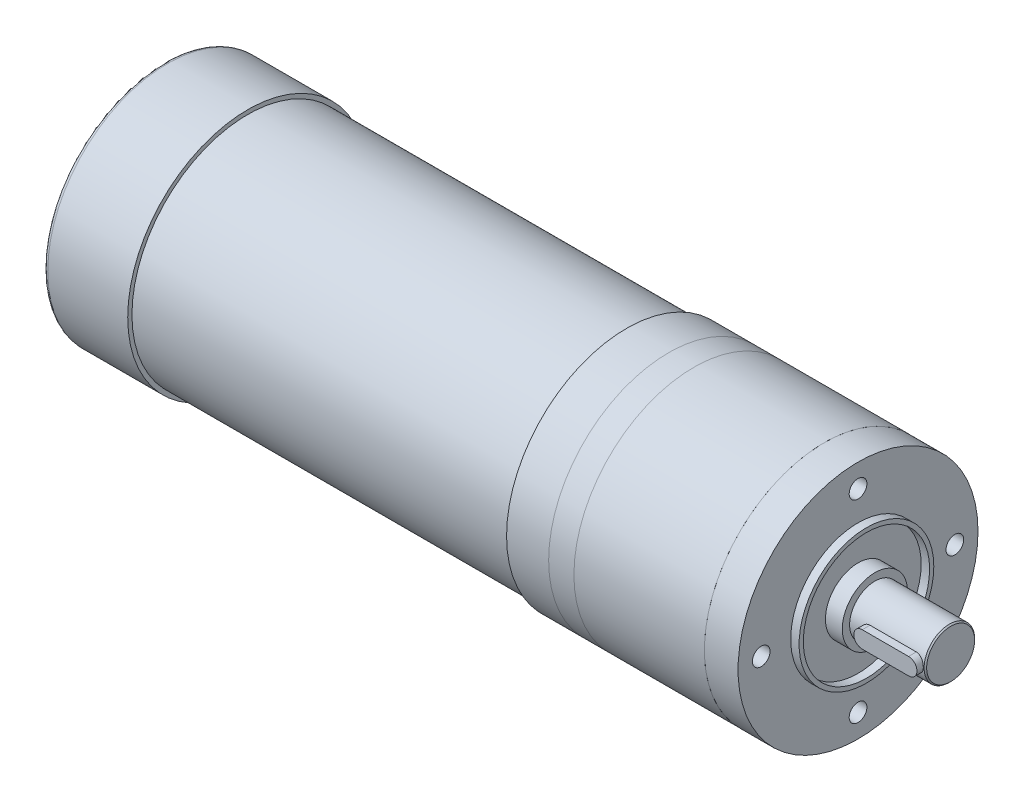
from build123d import *

# Parameters (mm, degrees)
SKETCH_1_R                  = 28.5
EXTRUDE_1_DEPTH             = 8
SKETCH_2_R                  = 28.5
EXTRUDE_2_DEPTH             = 31
SKETCH_3_R                  = 28.5
EXTRUDE_3_DEPTH             = 6
SKETCH_4_R                  = 28.5
EXTRUDE_4_DEPTH             = 10
SKETCH_5_R                  = 27.5
EXTRUDE_5_DEPTH             = 90
SKETCH_6_R                  = 28.5
EXTRUDE_6_DEPTH             = 20
FILLET_1_R                  = 1
SKETCH_7_R                  = 16
SKETCH_7_R_2                = 15
EXTRUDE_7_DEPTH             = 2
SKETCH_8_R                  = 7.75
EXTRUDE_8_DEPTH             = 4
SKETCH_9_R                  = 6
EXTRUDE_9_DEPTH             = 18
HOLE_WIZARD_M5_1_AT_2_COUNT = 2
HOLE_WIZARD_M5_1_AT_2_PITCH = 32.526911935
HOLE_WIZARD_M5_1_AT_3_COUNT = 2
HOLE_WIZARD_M5_1_AT_3_PITCH = 46
HOLE_WIZARD_M5_1_AT_4_COUNT = 2
HOLE_WIZARD_M5_1_AT_4_PITCH = 32.526911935
CUT_EXTRUDE_1_DEPTH         = 2.5
EXTRUDE_10_DEPTH            = 4
CHAMFER_1_SIZE              = 0.3


with BuildPart() as part:
    # Sketch 1 → Extrude 1 (new body)
    with BuildSketch(Plane(origin=(0, 0, 0), x_dir=(0, 0, -1), z_dir=(1, 0, 0))):
        Circle(SKETCH_1_R)
    extrude(amount=-EXTRUDE_1_DEPTH)

    # Sketch 7 → Extrude 7 (add)
    with BuildSketch(Plane(origin=(0, 0, 0), x_dir=(0, 0, -1), z_dir=(1, 0, 0))):
        Circle(SKETCH_7_R)
        Circle(SKETCH_7_R_2, mode=Mode.SUBTRACT)
    extrude(amount=EXTRUDE_7_DEPTH)

    # Sketch 8 → Extrude 8 (add)
    with BuildSketch(Plane(origin=(0, 0, 0), x_dir=(0, 0, -1), z_dir=(1, 0, 0))):
        Circle(SKETCH_8_R)
    extrude(amount=EXTRUDE_8_DEPTH)

    # Sketch 9 → Extrude 9 (add)
    with BuildSketch(Plane(origin=(4, 0, 0), x_dir=(0, 0, -1), z_dir=(1, 0, 0))):
        Circle(SKETCH_9_R)
    extrude(amount=EXTRUDE_9_DEPTH)


with BuildPart() as body_2:
    # Sketch 2 → Extrude 2 (new body)
    with BuildSketch(Plane.ZY.offset(8)):
        Circle(SKETCH_2_R)
    extrude(amount=EXTRUDE_2_DEPTH)


with BuildPart() as body_3:
    # Sketch 3 → Extrude 3 (new body)
    with BuildSketch(Plane.ZY.offset(39)):
        Circle(SKETCH_3_R)
    extrude(amount=EXTRUDE_3_DEPTH)


with BuildPart() as body_4:
    # Sketch 4 → Extrude 4 (new body)
    with BuildSketch(Plane.ZY.offset(45)):
        Circle(SKETCH_4_R)
    extrude(amount=EXTRUDE_4_DEPTH)

    # Sketch 5 → Extrude 5 (add)
    with BuildSketch(Plane.ZY.offset(55)):
        with Locations(Location((0, 0, 0), (0, 0, 180))):
            Circle(SKETCH_5_R)
    extrude(amount=EXTRUDE_5_DEPTH)

    # Sketch 6 → Extrude 6 (add)
    with BuildSketch(Plane.ZY.offset(145)):
        Circle(SKETCH_6_R)
    extrude(amount=EXTRUDE_6_DEPTH)

    # Fillet 1
    fillet_1_edges = [body_4.edges().sort_by_distance(p)[0] for p in [
        (-165, 0, -28.5),
    ]]
    fillet(fillet_1_edges, radius=FILLET_1_R)


with BuildPart() as hole_wizard_m5_1_tool:
    # Sketch 11 → Hole Wizard M5 _1 (revolve)
    with BuildSketch(Plane(origin=(0, 23, 0), x_dir=(0, 0, -1), z_dir=(0, 1, 0))):
        Polygon((0, 0), (0, 15.2618073), (2.1, 14), (2.1, 0), align=None)
    hole_wizard_m5_1 = revolve(axis=Axis((6.35, 23, 0), (-1, 0, 0)))


with BuildPart() as part_1:
    add(part.part)

    # Hole Wizard M5 _1: cut by hole_wizard_m5_1_tool
    add(hole_wizard_m5_1_tool.part, mode=Mode.SUBTRACT)


with BuildPart() as body_2_1:
    add(body_2.part)

    # Hole Wizard M5 _1: cut by hole_wizard_m5_1_tool
    add(hole_wizard_m5_1_tool.part, mode=Mode.SUBTRACT)


with BuildPart() as hole_wizard_m5_1_at_2_tool:
    # Hole Wizard M5 _1 at 2: Hole Wizard M5 _1 ×2
    with Locations(*[Vector(0, -0.7071067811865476, -0.7071067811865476) * (i * HOLE_WIZARD_M5_1_AT_2_PITCH) for i in range(1, HOLE_WIZARD_M5_1_AT_2_COUNT)]):
        add(hole_wizard_m5_1)


with BuildPart() as part_2:
    add(part_1.part)

    # Hole Wizard M5 _1 at 2: cut by hole_wizard_m5_1_at_2_tool
    add(hole_wizard_m5_1_at_2_tool.part, mode=Mode.SUBTRACT)


with BuildPart() as body_2_2:
    add(body_2_1.part)

    # Hole Wizard M5 _1 at 2: cut by hole_wizard_m5_1_at_2_tool
    add(hole_wizard_m5_1_at_2_tool.part, mode=Mode.SUBTRACT)


with BuildPart() as hole_wizard_m5_1_at_3_tool:
    # Hole Wizard M5 _1 at 3: Hole Wizard M5 _1 ×2
    with Locations(*[(0, -i * HOLE_WIZARD_M5_1_AT_3_PITCH, 0) for i in range(1, HOLE_WIZARD_M5_1_AT_3_COUNT)]):
        add(hole_wizard_m5_1)


with BuildPart() as part_3:
    add(part_2.part)

    # Hole Wizard M5 _1 at 3: cut by hole_wizard_m5_1_at_3_tool
    add(hole_wizard_m5_1_at_3_tool.part, mode=Mode.SUBTRACT)


with BuildPart() as body_2_3:
    add(body_2_2.part)

    # Hole Wizard M5 _1 at 3: cut by hole_wizard_m5_1_at_3_tool
    add(hole_wizard_m5_1_at_3_tool.part, mode=Mode.SUBTRACT)


with BuildPart() as hole_wizard_m5_1_at_4_tool:
    # Hole Wizard M5 _1 at 4: Hole Wizard M5 _1 ×2
    with Locations(*[Vector(0, -0.7071067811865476, 0.7071067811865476) * (i * HOLE_WIZARD_M5_1_AT_4_PITCH) for i in range(1, HOLE_WIZARD_M5_1_AT_4_COUNT)]):
        add(hole_wizard_m5_1)


with BuildPart() as part_4:
    add(part_3.part)

    # Hole Wizard M5 _1 at 4: cut by hole_wizard_m5_1_at_4_tool
    add(hole_wizard_m5_1_at_4_tool.part, mode=Mode.SUBTRACT)

    # Sketch 12 → Cut-Extrude 1 (cut)
    with BuildSketch(Plane.XY.offset(6)):
        with BuildLine():
            Line((8.5, 2), (19.5, 2))
            ThreePointArc((19.5, 2), (21.5, 0), (19.5, -2))
            Line((19.5, -2), (8.5, -2))
            ThreePointArc((8.5, -2), (6.5, 0), (8.5, 2))
        make_face()
    extrude(amount=-CUT_EXTRUDE_1_DEPTH, mode=Mode.SUBTRACT)

    # Chamfer 1
    chamfer_1_edges = [part_4.edges().sort_by_distance(p)[0] for p in [
        (22, 0, 6),
    ]]
    chamfer(chamfer_1_edges, length=CHAMFER_1_SIZE)


with BuildPart() as body_2_4:
    add(body_2_3.part)

    # Hole Wizard M5 _1 at 4: cut by hole_wizard_m5_1_at_4_tool
    add(hole_wizard_m5_1_at_4_tool.part, mode=Mode.SUBTRACT)


with BuildPart() as body_5:
    # Sketch 13 → Extrude 10 (new body)
    with BuildSketch(Plane.XY.offset(3.5)):
        with BuildLine():
            Line((8.5, 2), (19.5, 2))
            ThreePointArc((19.5, 2), (21.5, 0), (19.5, -2))
            Line((19.5, -2), (8.5, -2))
            ThreePointArc((8.5, -2), (6.5, 0), (8.5, 2))
        make_face()
    extrude(amount=EXTRUDE_10_DEPTH)


solid = Compound([body_3.part, body_4.part, part_4.part, body_2_4.part, body_5.part])
